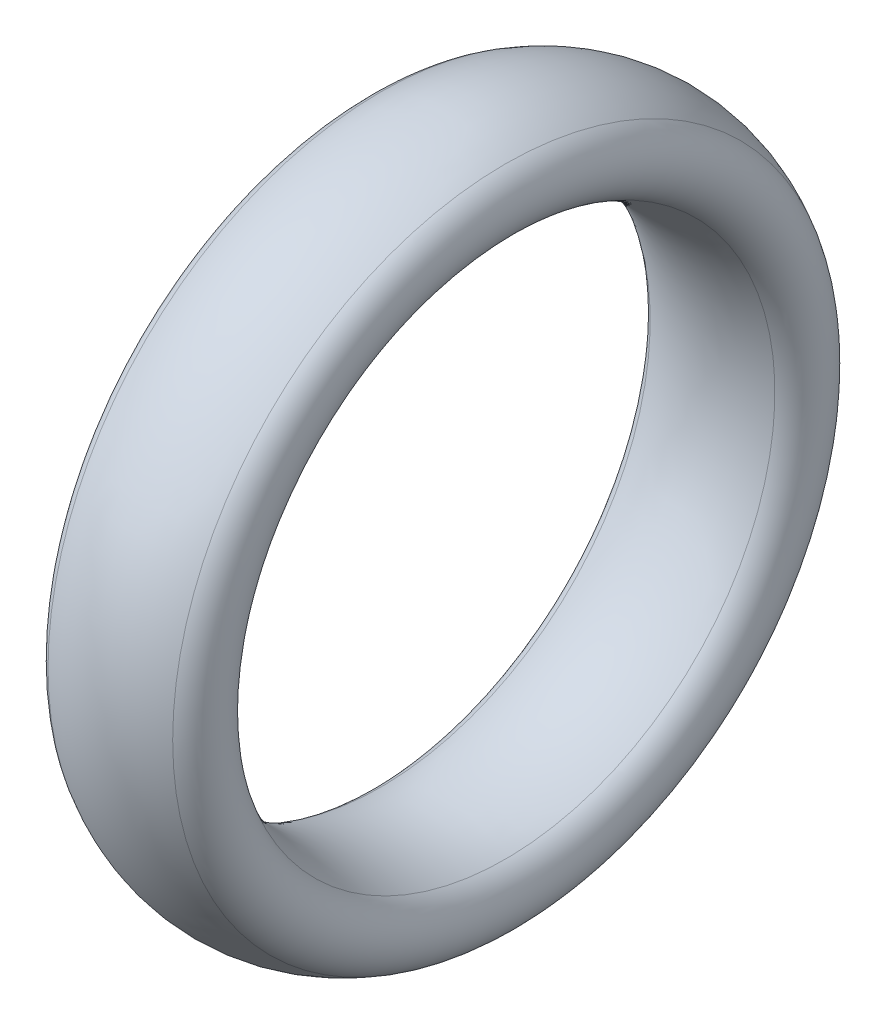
ISO-10303-21;
HEADER;
FILE_DESCRIPTION(('STEP AP214'),'2;1');
FILE_NAME('part.step','',(''),(''),'','','');
FILE_SCHEMA(('AUTOMOTIVE_DESIGN { 1 0 10303 214 1 1 1 1 }'));
ENDSEC;
DATA;
#1=APPLICATION_CONTEXT('core data for automotive mechanical design processes');
#2=APPLICATION_PROTOCOL_DEFINITION('international standard','automotive_design',2000,#1);
#3=PRODUCT_CONTEXT('',#1,'mechanical');
#4=PRODUCT('Part','Part','',(#3));
#5=PRODUCT_RELATED_PRODUCT_CATEGORY('part','',(#4));
#6=PRODUCT_DEFINITION_FORMATION('','',#4);
#7=PRODUCT_DEFINITION_CONTEXT('part definition',#1,'design');
#8=PRODUCT_DEFINITION('design','',#6,#7);
#9=PRODUCT_DEFINITION_SHAPE('','',#8);
#10=(LENGTH_UNIT() NAMED_UNIT(*) SI_UNIT(.MILLI.,.METRE.));
#11=(NAMED_UNIT(*) PLANE_ANGLE_UNIT() SI_UNIT($,.RADIAN.));
#12=(NAMED_UNIT(*) SI_UNIT($,.STERADIAN.) SOLID_ANGLE_UNIT());
#13=UNCERTAINTY_MEASURE_WITH_UNIT(LENGTH_MEASURE(1.E-05),#10,'distance_accuracy_value','');
#14=(GEOMETRIC_REPRESENTATION_CONTEXT(3) GLOBAL_UNCERTAINTY_ASSIGNED_CONTEXT((#13)) GLOBAL_UNIT_ASSIGNED_CONTEXT((#10,
#11,#12)) REPRESENTATION_CONTEXT('',''));
#15=CARTESIAN_POINT('',(0.,0.,0.));
#16=DIRECTION('',(0.,0.,1.));
#17=DIRECTION('',(1.,0.,0.));
#18=AXIS2_PLACEMENT_3D('',#15,#16,#17);
#19=CARTESIAN_POINT('',(21.2428866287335,-7.46653918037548,0.));
#20=DIRECTION('',(-1.,0.,0.));
#21=DIRECTION('',(0.,0.,1.));
#22=AXIS2_PLACEMENT_3D('',#19,#20,#21);
#23=TOROIDAL_SURFACE('',#22,5.53711599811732,3.12096236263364);
#24=CARTESIAN_POINT('',(19.6971339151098,-7.46653918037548,0.));
#25=DIRECTION('',(-1.,0.,0.));
#26=DIRECTION('',(0.,0.,1.));
#27=AXIS2_PLACEMENT_3D('',#24,#25,#26);
#28=CIRCLE('',#27,8.24839883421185);
#29=CARTESIAN_POINT('',(19.6971339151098,-7.46653918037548,8.24839883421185));
#30=VERTEX_POINT('',#29);
#31=EDGE_CURVE('E10',#30,#30,#28,.T.);
#32=ORIENTED_EDGE('',*,*,#31,.F.);
#33=EDGE_LOOP('',(#32));
#34=FACE_BOUND('',#33,.T.);
#35=CARTESIAN_POINT('',(22.7886393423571,-7.46653918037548,0.));
#36=DIRECTION('',(-1.,0.,0.));
#37=DIRECTION('',(0.,0.,1.));
#38=AXIS2_PLACEMENT_3D('',#35,#36,#37);
#39=CIRCLE('',#38,8.24839883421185);
#40=CARTESIAN_POINT('',(22.7886393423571,-7.46653918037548,8.24839883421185));
#41=VERTEX_POINT('',#40);
#42=EDGE_CURVE('E49',#41,#41,#39,.T.);
#43=ORIENTED_EDGE('',*,*,#42,.T.);
#44=EDGE_LOOP('',(#43));
#45=FACE_BOUND('',#44,.T.);
#46=ADVANCED_FACE('F35',(#34,#45),#23,.T.);
#47=CARTESIAN_POINT('',(20.1428866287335,-7.46653918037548,0.));
#48=DIRECTION('',(-1.,0.,0.));
#49=DIRECTION('',(0.,0.,1.));
#50=AXIS2_PLACEMENT_3D('',#47,#48,#49);
#51=TOROIDAL_SURFACE('',#50,7.46653918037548,0.900000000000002);
#52=CARTESIAN_POINT('',(19.6971339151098,-7.46653918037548,0.));
#53=DIRECTION('',(-1.,0.,0.));
#54=DIRECTION('',(0.,0.,1.));
#55=AXIS2_PLACEMENT_3D('',#52,#53,#54);
#56=CIRCLE('',#55,6.68467952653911);
#57=CARTESIAN_POINT('',(19.6971339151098,-7.46653918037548,6.68467952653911));
#58=VERTEX_POINT('',#57);
#59=EDGE_CURVE('E41',#58,#58,#56,.T.);
#60=ORIENTED_EDGE('',*,*,#59,.F.);
#61=EDGE_LOOP('',(#60));
#62=FACE_BOUND('',#61,.T.);
#63=ORIENTED_EDGE('',*,*,#31,.T.);
#64=EDGE_LOOP('',(#63));
#65=FACE_BOUND('',#64,.T.);
#66=ADVANCED_FACE('F64',(#62,#65),#51,.T.);
#67=CARTESIAN_POINT('',(21.2428866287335,-7.46653918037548,0.));
#68=DIRECTION('',(-1.,0.,0.));
#69=DIRECTION('',(0.,0.,1.));
#70=AXIS2_PLACEMENT_3D('',#67,#68,#69);
#71=TOROIDAL_SURFACE('',#70,9.39596236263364,3.12096236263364);
#72=CARTESIAN_POINT('',(22.7886393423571,-7.46653918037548,0.));
#73=DIRECTION('',(-1.,0.,0.));
#74=DIRECTION('',(0.,0.,1.));
#75=AXIS2_PLACEMENT_3D('',#72,#73,#74);
#76=CIRCLE('',#75,6.68467952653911);
#77=CARTESIAN_POINT('',(22.7886393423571,-7.46653918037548,6.68467952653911));
#78=VERTEX_POINT('',#77);
#79=EDGE_CURVE('E45',#78,#78,#76,.T.);
#80=ORIENTED_EDGE('',*,*,#79,.F.);
#81=EDGE_LOOP('',(#80));
#82=FACE_BOUND('',#81,.T.);
#83=ORIENTED_EDGE('',*,*,#59,.T.);
#84=EDGE_LOOP('',(#83));
#85=FACE_BOUND('',#84,.T.);
#86=ADVANCED_FACE('F59',(#82,#85),#71,.T.);
#87=CARTESIAN_POINT('',(22.3428866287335,-7.46653918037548,0.));
#88=DIRECTION('',(-1.,0.,0.));
#89=DIRECTION('',(0.,0.,1.));
#90=AXIS2_PLACEMENT_3D('',#87,#88,#89);
#91=TOROIDAL_SURFACE('',#90,7.46653918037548,0.899999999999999);
#92=ORIENTED_EDGE('',*,*,#42,.F.);
#93=EDGE_LOOP('',(#92));
#94=FACE_BOUND('',#93,.T.);
#95=ORIENTED_EDGE('',*,*,#79,.T.);
#96=EDGE_LOOP('',(#95));
#97=FACE_BOUND('',#96,.T.);
#98=ADVANCED_FACE('F56',(#94,#97),#91,.T.);
#99=CLOSED_SHELL('',(#46,#66,#86,#98));
#100=MANIFOLD_SOLID_BREP('B2',#99);
#101=ADVANCED_BREP_SHAPE_REPRESENTATION('',(#18,#100),#14);
#102=SHAPE_DEFINITION_REPRESENTATION(#9,#101);
ENDSEC;
END-ISO-10303-21;
